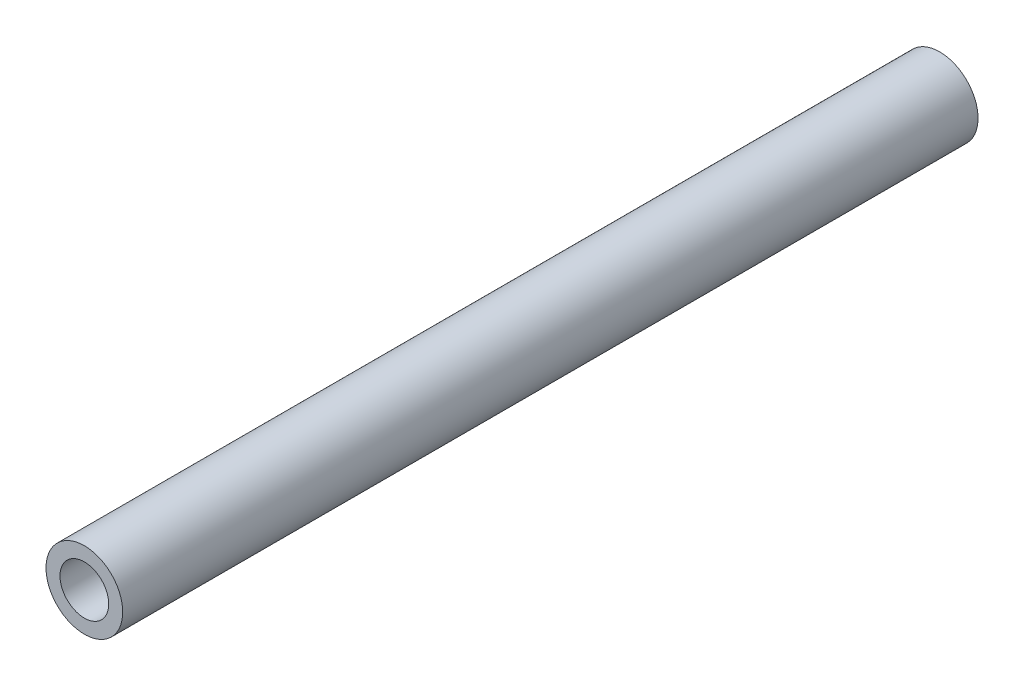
from build123d import *

# Parameters (mm, degrees)
SKETCH_1_R      = 5
SKETCH_1_R_2    = 3.175
EXTRUDE_1_DEPTH = 111.5


with BuildPart() as part:
    # Sketch 1 → Extrude 1 (new body)
    with BuildSketch(Plane.XY):
        with Locations(Location((0, 0, 0), (0, 0, 180))):
            Circle(SKETCH_1_R)
        with Locations(Location((0, 0, 0), (0, 0, 180))):
            Circle(SKETCH_1_R_2, mode=Mode.SUBTRACT)
    extrude(amount=EXTRUDE_1_DEPTH)


solid = part.part
